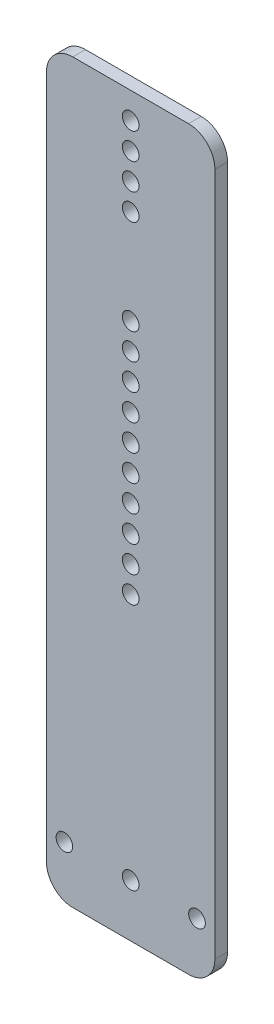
from build123d import *

# Parameters (mm, degrees)
SKETCH1_W           = 40.64
SKETCH1_H           = 177.8
BOSS_EXTRUDE1_DEPTH = 3.048
SKETCH2_R           = 2.0066
CUT_EXTRUDE1_DEPTH  = 3.048
SKETCH3_R           = 2.0193
CUT_EXTRUDE2_DEPTH  = 92.243644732
FILLET1_R           = 6.35


with BuildPart() as part:
    # Sketch1 → Boss-Extrude1 (new body)
    with BuildSketch(Plane.XY):
        Rectangle(SKETCH1_W, SKETCH1_H)
    extrude(amount=BOSS_EXTRUDE1_DEPTH)

    # Sketch2 → Cut-Extrude1 (cut)
    with BuildSketch(Plane.XY.offset(3.048)):
        with Locations((0, -76.2)):
            Circle(SKETCH2_R)
        with Locations((0, 82.55)):
            Circle(SKETCH2_R)
        with Locations((0, 76.2)):
            Circle(SKETCH2_R)
        with Locations((0, 69.85)):
            Circle(SKETCH2_R)
        with Locations((0, 63.5)):
            Circle(SKETCH2_R)
        with Locations((16.002, -76.2)):
            Circle(SKETCH2_R)
        with Locations((-16.002, -76.2)):
            Circle(SKETCH2_R)
    extrude(amount=-CUT_EXTRUDE1_DEPTH, mode=Mode.SUBTRACT)

    # Sketch3 → Cut-Extrude2 (cut, through all)
    with BuildSketch(Plane.XY.offset(3.048)):
        with Locations((0, -16.4846)):
            Circle(SKETCH3_R)
        with Locations((0, -10.1346)):
            Circle(SKETCH3_R)
        with Locations((0, -3.7846)):
            Circle(SKETCH3_R)
        with Locations((0, 2.5654)):
            Circle(SKETCH3_R)
        with Locations((0, 8.9154)):
            Circle(SKETCH3_R)
        with Locations((0, 15.2654)):
            Circle(SKETCH3_R)
        with Locations((0, 21.6154)):
            Circle(SKETCH3_R)
        with Locations((0, 27.9654)):
            Circle(SKETCH3_R)
        with Locations((0, 34.3154)):
            Circle(SKETCH3_R)
        with Locations((0, 40.6654)):
            Circle(SKETCH3_R)
    extrude(amount=-CUT_EXTRUDE2_DEPTH, mode=Mode.SUBTRACT)

    # Fillet1
    fillet1_edges = [part.edges().sort_by_distance(p)[0] for p in [
        (20.32, -88.9, 1.524),
        (-20.32, -88.9, 1.524),
        (-20.32, 88.9, 1.524),
        (20.32, 88.9, 1.524),
    ]]
    fillet(fillet1_edges, radius=FILLET1_R)


solid = part.part
